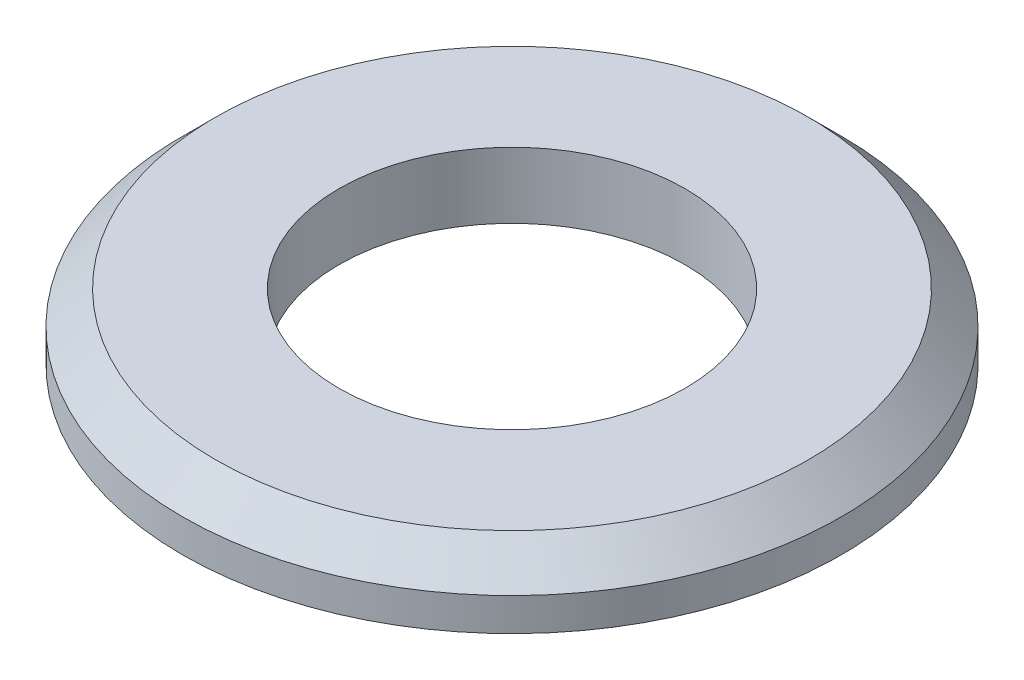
ISO-10303-21;
HEADER;
FILE_DESCRIPTION(('STEP AP214'),'2;1');
FILE_NAME('part.step','',(''),(''),'','','');
FILE_SCHEMA(('AUTOMOTIVE_DESIGN { 1 0 10303 214 1 1 1 1 }'));
ENDSEC;
DATA;
#1=APPLICATION_CONTEXT('core data for automotive mechanical design processes');
#2=APPLICATION_PROTOCOL_DEFINITION('international standard','automotive_design',2000,#1);
#3=PRODUCT_CONTEXT('',#1,'mechanical');
#4=PRODUCT('Part','Part','',(#3));
#5=PRODUCT_RELATED_PRODUCT_CATEGORY('part','',(#4));
#6=PRODUCT_DEFINITION_FORMATION('','',#4);
#7=PRODUCT_DEFINITION_CONTEXT('part definition',#1,'design');
#8=PRODUCT_DEFINITION('design','',#6,#7);
#9=PRODUCT_DEFINITION_SHAPE('','',#8);
#10=(LENGTH_UNIT() NAMED_UNIT(*) SI_UNIT(.MILLI.,.METRE.));
#11=(NAMED_UNIT(*) PLANE_ANGLE_UNIT() SI_UNIT($,.RADIAN.));
#12=(NAMED_UNIT(*) SI_UNIT($,.STERADIAN.) SOLID_ANGLE_UNIT());
#13=UNCERTAINTY_MEASURE_WITH_UNIT(LENGTH_MEASURE(1.E-05),#10,'distance_accuracy_value','');
#14=(GEOMETRIC_REPRESENTATION_CONTEXT(3) GLOBAL_UNCERTAINTY_ASSIGNED_CONTEXT((#13)) GLOBAL_UNIT_ASSIGNED_CONTEXT((#10,
#11,#12)) REPRESENTATION_CONTEXT('',''));
#15=CARTESIAN_POINT('',(0.,0.,0.));
#16=DIRECTION('',(0.,0.,1.));
#17=DIRECTION('',(1.,0.,0.));
#18=AXIS2_PLACEMENT_3D('',#15,#16,#17);
#19=CARTESIAN_POINT('',(0.,1.6,0.));
#20=DIRECTION('',(0.,1.,0.));
#21=DIRECTION('',(0.,0.,1.));
#22=AXIS2_PLACEMENT_3D('',#19,#20,#21);
#23=PLANE('',#22);
#24=CARTESIAN_POINT('',(0.,1.6,0.));
#25=DIRECTION('',(0.,1.,0.));
#26=DIRECTION('',(0.,0.,1.));
#27=AXIS2_PLACEMENT_3D('',#24,#25,#26);
#28=CIRCLE('',#27,7.19999999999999);
#29=CARTESIAN_POINT('',(0.,1.6,7.19999999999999));
#30=VERTEX_POINT('',#29);
#31=EDGE_CURVE('E35',#30,#30,#28,.T.);
#32=ORIENTED_EDGE('',*,*,#31,.T.);
#33=EDGE_LOOP('',(#32));
#34=FACE_BOUND('',#33,.T.);
#35=CARTESIAN_POINT('',(0.,1.6,0.));
#36=DIRECTION('',(0.,1.,0.));
#37=DIRECTION('',(0.,0.,1.));
#38=AXIS2_PLACEMENT_3D('',#35,#36,#37);
#39=CIRCLE('',#38,4.2);
#40=CARTESIAN_POINT('',(0.,1.6,4.2));
#41=VERTEX_POINT('',#40);
#42=EDGE_CURVE('E43',#41,#41,#39,.T.);
#43=ORIENTED_EDGE('',*,*,#42,.F.);
#44=EDGE_LOOP('',(#43));
#45=FACE_BOUND('',#44,.T.);
#46=ADVANCED_FACE('F28',(#34,#45),#23,.T.);
#47=CARTESIAN_POINT('',(0.,0.,0.));
#48=DIRECTION('',(0.,1.,0.));
#49=DIRECTION('',(0.,0.,1.));
#50=AXIS2_PLACEMENT_3D('',#47,#48,#49);
#51=PLANE('',#50);
#52=CARTESIAN_POINT('',(0.,0.,0.));
#53=DIRECTION('',(0.,1.,0.));
#54=DIRECTION('',(0.,0.,1.));
#55=AXIS2_PLACEMENT_3D('',#52,#53,#54);
#56=CIRCLE('',#55,8.);
#57=CARTESIAN_POINT('',(0.,0.,8.));
#58=VERTEX_POINT('',#57);
#59=EDGE_CURVE('E39',#58,#58,#56,.T.);
#60=ORIENTED_EDGE('',*,*,#59,.F.);
#61=EDGE_LOOP('',(#60));
#62=FACE_BOUND('',#61,.T.);
#63=CARTESIAN_POINT('',(0.,0.,0.));
#64=DIRECTION('',(0.,1.,0.));
#65=DIRECTION('',(0.,0.,1.));
#66=AXIS2_PLACEMENT_3D('',#63,#64,#65);
#67=CIRCLE('',#66,4.2);
#68=CARTESIAN_POINT('',(0.,0.,4.2));
#69=VERTEX_POINT('',#68);
#70=EDGE_CURVE('E48',#69,#69,#67,.T.);
#71=ORIENTED_EDGE('',*,*,#70,.T.);
#72=EDGE_LOOP('',(#71));
#73=FACE_BOUND('',#72,.T.);
#74=ADVANCED_FACE('F52',(#62,#73),#51,.F.);
#75=CARTESIAN_POINT('',(0.,1.6,0.));
#76=DIRECTION('',(0.,-1.,0.));
#77=DIRECTION('',(0.,0.,-1.));
#78=AXIS2_PLACEMENT_3D('',#75,#76,#77);
#79=CYLINDRICAL_SURFACE('',#78,8.);
#80=CARTESIAN_POINT('',(0.,0.799999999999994,0.));
#81=DIRECTION('',(0.,1.,0.));
#82=DIRECTION('',(0.,0.,1.));
#83=AXIS2_PLACEMENT_3D('',#80,#81,#82);
#84=CIRCLE('',#83,8.);
#85=CARTESIAN_POINT('',(0.,0.799999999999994,8.));
#86=VERTEX_POINT('',#85);
#87=EDGE_CURVE('E10',#86,#86,#84,.F.);
#88=ORIENTED_EDGE('',*,*,#87,.T.);
#89=EDGE_LOOP('',(#88));
#90=FACE_BOUND('',#89,.T.);
#91=ORIENTED_EDGE('',*,*,#59,.T.);
#92=EDGE_LOOP('',(#91));
#93=FACE_BOUND('',#92,.T.);
#94=ADVANCED_FACE('F30',(#90,#93),#79,.T.);
#95=CARTESIAN_POINT('',(0.,1.6,0.));
#96=DIRECTION('',(0.,-1.,0.));
#97=DIRECTION('',(0.,0.,-1.));
#98=AXIS2_PLACEMENT_3D('',#95,#96,#97);
#99=CYLINDRICAL_SURFACE('',#98,4.2);
#100=ORIENTED_EDGE('',*,*,#42,.T.);
#101=EDGE_LOOP('',(#100));
#102=FACE_BOUND('',#101,.T.);
#103=ORIENTED_EDGE('',*,*,#70,.F.);
#104=EDGE_LOOP('',(#103));
#105=FACE_BOUND('',#104,.T.);
#106=ADVANCED_FACE('F54',(#102,#105),#99,.F.);
#107=CARTESIAN_POINT('',(0.,1.6,0.));
#108=DIRECTION('',(0.,-1.,0.));
#109=DIRECTION('',(0.,0.,-1.));
#110=AXIS2_PLACEMENT_3D('',#107,#108,#109);
#111=CONICAL_SURFACE('',#110,7.19999999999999,0.785398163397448);
#112=ORIENTED_EDGE('',*,*,#87,.F.);
#113=EDGE_LOOP('',(#112));
#114=FACE_BOUND('',#113,.T.);
#115=ORIENTED_EDGE('',*,*,#31,.F.);
#116=EDGE_LOOP('',(#115));
#117=FACE_BOUND('',#116,.T.);
#118=ADVANCED_FACE('F56',(#114,#117),#111,.T.);
#119=CLOSED_SHELL('',(#46,#74,#94,#106,#118));
#120=MANIFOLD_SOLID_BREP('B2',#119);
#121=ADVANCED_BREP_SHAPE_REPRESENTATION('',(#18,#120),#14);
#122=SHAPE_DEFINITION_REPRESENTATION(#9,#121);
ENDSEC;
END-ISO-10303-21;
